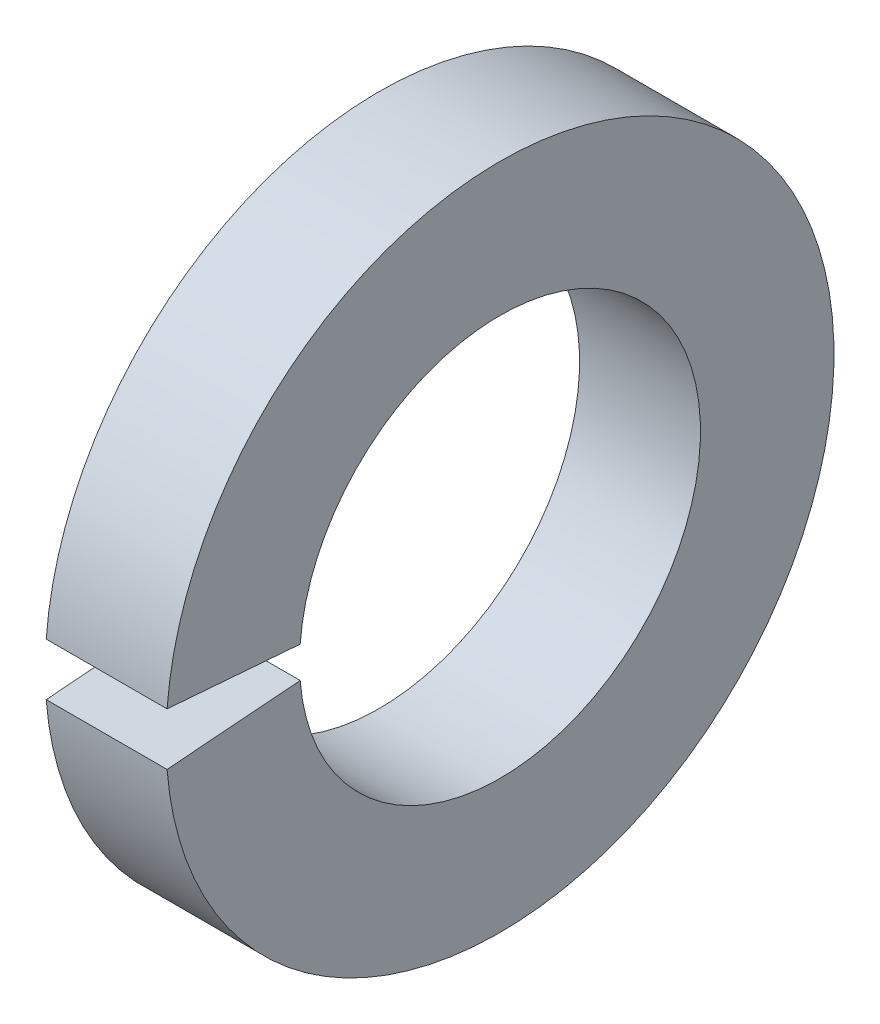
ISO-10303-21;
HEADER;
FILE_DESCRIPTION(('STEP AP214'),'2;1');
FILE_NAME('part.step','',(''),(''),'','','');
FILE_SCHEMA(('AUTOMOTIVE_DESIGN { 1 0 10303 214 1 1 1 1 }'));
ENDSEC;
DATA;
#1=APPLICATION_CONTEXT('core data for automotive mechanical design processes');
#2=APPLICATION_PROTOCOL_DEFINITION('international standard','automotive_design',2000,#1);
#3=PRODUCT_CONTEXT('',#1,'mechanical');
#4=PRODUCT('Part','Part','',(#3));
#5=PRODUCT_RELATED_PRODUCT_CATEGORY('part','',(#4));
#6=PRODUCT_DEFINITION_FORMATION('','',#4);
#7=PRODUCT_DEFINITION_CONTEXT('part definition',#1,'design');
#8=PRODUCT_DEFINITION('design','',#6,#7);
#9=PRODUCT_DEFINITION_SHAPE('','',#8);
#10=(LENGTH_UNIT() NAMED_UNIT(*) SI_UNIT(.MILLI.,.METRE.));
#11=(NAMED_UNIT(*) PLANE_ANGLE_UNIT() SI_UNIT($,.RADIAN.));
#12=(NAMED_UNIT(*) SI_UNIT($,.STERADIAN.) SOLID_ANGLE_UNIT());
#13=UNCERTAINTY_MEASURE_WITH_UNIT(LENGTH_MEASURE(1.E-05),#10,'distance_accuracy_value','');
#14=(GEOMETRIC_REPRESENTATION_CONTEXT(3) GLOBAL_UNCERTAINTY_ASSIGNED_CONTEXT((#13)) GLOBAL_UNIT_ASSIGNED_CONTEXT((#10,
#11,#12)) REPRESENTATION_CONTEXT('',''));
#15=CARTESIAN_POINT('',(0.,0.,0.));
#16=DIRECTION('',(0.,0.,1.));
#17=DIRECTION('',(1.,0.,0.));
#18=AXIS2_PLACEMENT_3D('',#15,#16,#17);
#19=CARTESIAN_POINT('',(-34.9249999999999,0.,0.));
#20=DIRECTION('',(-1.,0.,0.));
#21=DIRECTION('',(0.,0.,1.));
#22=AXIS2_PLACEMENT_3D('',#19,#20,#21);
#23=CYLINDRICAL_SURFACE('',#22,12.8905);
#24=CARTESIAN_POINT('',(0.,0.,0.));
#25=DIRECTION('',(-1.,0.,0.));
#26=DIRECTION('',(0.,0.,1.));
#27=AXIS2_PLACEMENT_3D('',#24,#25,#26);
#28=CIRCLE('',#27,12.8905);
#29=CARTESIAN_POINT('',(0.,1.01137697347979,12.8507628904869));
#30=VERTEX_POINT('',#29);
#31=CARTESIAN_POINT('',(0.,-1.01137697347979,12.8507628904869));
#32=VERTEX_POINT('',#31);
#33=EDGE_CURVE('E84',#30,#32,#28,.T.);
#34=ORIENTED_EDGE('',*,*,#33,.F.);
#35=DIRECTION('',(-1.,0.,0.));
#36=VECTOR('',#35,1.);
#37=CARTESIAN_POINT('',(-34.9249999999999,1.01137697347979,12.8507628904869));
#38=LINE('',#37,#36);
#39=CARTESIAN_POINT('',(-7.7724,1.01137697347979,12.8507628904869));
#40=VERTEX_POINT('',#39);
#41=EDGE_CURVE('E98',#30,#40,#38,.T.);
#42=ORIENTED_EDGE('',*,*,#41,.T.);
#43=CARTESIAN_POINT('',(-7.7724,0.,0.));
#44=DIRECTION('',(-1.,0.,0.));
#45=DIRECTION('',(0.,0.,1.));
#46=AXIS2_PLACEMENT_3D('',#43,#44,#45);
#47=CIRCLE('',#46,12.8905);
#48=CARTESIAN_POINT('',(-7.7724,-1.01137697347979,12.8507628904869));
#49=VERTEX_POINT('',#48);
#50=EDGE_CURVE('E86',#40,#49,#47,.T.);
#51=ORIENTED_EDGE('',*,*,#50,.T.);
#52=DIRECTION('',(-1.,0.,0.));
#53=VECTOR('',#52,1.);
#54=CARTESIAN_POINT('',(-34.9249999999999,-1.01137697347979,12.8507628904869));
#55=LINE('',#54,#53);
#56=EDGE_CURVE('E54',#32,#49,#55,.T.);
#57=ORIENTED_EDGE('',*,*,#56,.F.);
#58=EDGE_LOOP('',(#34,#42,#51,#57));
#59=FACE_BOUND('',#58,.T.);
#60=ADVANCED_FACE('F33',(#59),#23,.F.);
#61=CARTESIAN_POINT('',(0.,12.8905,0.));
#62=DIRECTION('',(-1.,0.,0.));
#63=DIRECTION('',(0.,0.,1.));
#64=AXIS2_PLACEMENT_3D('',#61,#62,#63);
#65=PLANE('',#64);
#66=CARTESIAN_POINT('',(0.,0.,0.));
#67=DIRECTION('',(-1.,0.,0.));
#68=DIRECTION('',(0.,0.,1.));
#69=AXIS2_PLACEMENT_3D('',#66,#67,#68);
#70=CIRCLE('',#69,21.4757);
#71=CARTESIAN_POINT('',(0.,1.68496400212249,21.4094975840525));
#72=VERTEX_POINT('',#71);
#73=CARTESIAN_POINT('',(0.,-1.68496400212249,21.4094975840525));
#74=VERTEX_POINT('',#73);
#75=EDGE_CURVE('E90',#72,#74,#70,.T.);
#76=ORIENTED_EDGE('',*,*,#75,.F.);
#77=DIRECTION('',(0.,0.0784590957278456,0.996917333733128));
#78=VECTOR('',#77,1.);
#79=CARTESIAN_POINT('',(0.,0.,0.));
#80=LINE('',#79,#78);
#81=EDGE_CURVE('E78',#30,#72,#80,.T.);
#82=ORIENTED_EDGE('',*,*,#81,.F.);
#83=ORIENTED_EDGE('',*,*,#33,.T.);
#84=DIRECTION('',(0.,-0.0784590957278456,0.996917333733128));
#85=VECTOR('',#84,1.);
#86=CARTESIAN_POINT('',(0.,0.,0.));
#87=LINE('',#86,#85);
#88=EDGE_CURVE('E70',#32,#74,#87,.T.);
#89=ORIENTED_EDGE('',*,*,#88,.T.);
#90=EDGE_LOOP('',(#76,#82,#83,#89));
#91=FACE_BOUND('',#90,.T.);
#92=ADVANCED_FACE('F89',(#91),#65,.F.);
#93=CARTESIAN_POINT('',(-34.9249999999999,0.,0.));
#94=DIRECTION('',(-1.,0.,0.));
#95=DIRECTION('',(0.,0.,1.));
#96=AXIS2_PLACEMENT_3D('',#93,#94,#95);
#97=CYLINDRICAL_SURFACE('',#96,21.4757);
#98=CARTESIAN_POINT('',(-7.7724,0.,0.));
#99=DIRECTION('',(-1.,0.,0.));
#100=DIRECTION('',(0.,0.,1.));
#101=AXIS2_PLACEMENT_3D('',#98,#99,#100);
#102=CIRCLE('',#101,21.4757);
#103=CARTESIAN_POINT('',(-7.7724,1.68496400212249,21.4094975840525));
#104=VERTEX_POINT('',#103);
#105=CARTESIAN_POINT('',(-7.7724,-1.68496400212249,21.4094975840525));
#106=VERTEX_POINT('',#105);
#107=EDGE_CURVE('E92',#104,#106,#102,.T.);
#108=ORIENTED_EDGE('',*,*,#107,.F.);
#109=DIRECTION('',(-1.,0.,0.));
#110=VECTOR('',#109,1.);
#111=CARTESIAN_POINT('',(-34.9249999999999,1.68496400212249,21.4094975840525));
#112=LINE('',#111,#110);
#113=EDGE_CURVE('E47',#104,#72,#112,.F.);
#114=ORIENTED_EDGE('',*,*,#113,.T.);
#115=ORIENTED_EDGE('',*,*,#75,.T.);
#116=DIRECTION('',(-1.,0.,0.));
#117=VECTOR('',#116,1.);
#118=CARTESIAN_POINT('',(-34.9249999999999,-1.68496400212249,21.4094975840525));
#119=LINE('',#118,#117);
#120=EDGE_CURVE('E73',#106,#74,#119,.F.);
#121=ORIENTED_EDGE('',*,*,#120,.F.);
#122=EDGE_LOOP('',(#108,#114,#115,#121));
#123=FACE_BOUND('',#122,.T.);
#124=ADVANCED_FACE('F105',(#123),#97,.T.);
#125=CARTESIAN_POINT('',(-7.7724,21.4757,0.));
#126=DIRECTION('',(1.,0.,0.));
#127=DIRECTION('',(0.,0.,-1.));
#128=AXIS2_PLACEMENT_3D('',#125,#126,#127);
#129=PLANE('',#128);
#130=ORIENTED_EDGE('',*,*,#50,.F.);
#131=DIRECTION('',(0.,0.0784590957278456,0.996917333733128));
#132=VECTOR('',#131,1.);
#133=CARTESIAN_POINT('',(-7.7724,0.132200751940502,1.67976982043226));
#134=LINE('',#133,#132);
#135=EDGE_CURVE('E11',#40,#104,#134,.T.);
#136=ORIENTED_EDGE('',*,*,#135,.T.);
#137=ORIENTED_EDGE('',*,*,#107,.T.);
#138=DIRECTION('',(0.,-0.0784590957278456,0.996917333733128));
#139=VECTOR('',#138,1.);
#140=CARTESIAN_POINT('',(-7.7724,0.132200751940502,-1.67976982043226));
#141=LINE('',#140,#139);
#142=EDGE_CURVE('E40',#49,#106,#141,.T.);
#143=ORIENTED_EDGE('',*,*,#142,.F.);
#144=EDGE_LOOP('',(#130,#136,#137,#143));
#145=FACE_BOUND('',#144,.T.);
#146=ADVANCED_FACE('F107',(#145),#129,.F.);
#147=CARTESIAN_POINT('',(-7.7724,0.,0.));
#148=DIRECTION('',(0.,0.996917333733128,0.0784590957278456));
#149=DIRECTION('',(0.,-0.0784590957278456,0.996917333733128));
#150=AXIS2_PLACEMENT_3D('',#147,#148,#149);
#151=PLANE('',#150);
#152=ORIENTED_EDGE('',*,*,#56,.T.);
#153=ORIENTED_EDGE('',*,*,#142,.T.);
#154=ORIENTED_EDGE('',*,*,#120,.T.);
#155=ORIENTED_EDGE('',*,*,#88,.F.);
#156=EDGE_LOOP('',(#152,#153,#154,#155));
#157=FACE_BOUND('',#156,.T.);
#158=ADVANCED_FACE('F71',(#157),#151,.T.);
#159=CARTESIAN_POINT('',(-7.7724,0.,0.));
#160=DIRECTION('',(0.,0.996917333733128,-0.0784590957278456));
#161=DIRECTION('',(0.,0.0784590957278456,0.996917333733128));
#162=AXIS2_PLACEMENT_3D('',#159,#160,#161);
#163=PLANE('',#162);
#164=ORIENTED_EDGE('',*,*,#81,.T.);
#165=ORIENTED_EDGE('',*,*,#113,.F.);
#166=ORIENTED_EDGE('',*,*,#135,.F.);
#167=ORIENTED_EDGE('',*,*,#41,.F.);
#168=EDGE_LOOP('',(#164,#165,#166,#167));
#169=FACE_BOUND('',#168,.T.);
#170=ADVANCED_FACE('F102',(#169),#163,.F.);
#171=CLOSED_SHELL('',(#60,#92,#124,#146,#158,#170));
#172=MANIFOLD_SOLID_BREP('B2',#171);
#173=ADVANCED_BREP_SHAPE_REPRESENTATION('',(#18,#172),#14);
#174=SHAPE_DEFINITION_REPRESENTATION(#9,#173);
ENDSEC;
END-ISO-10303-21;
